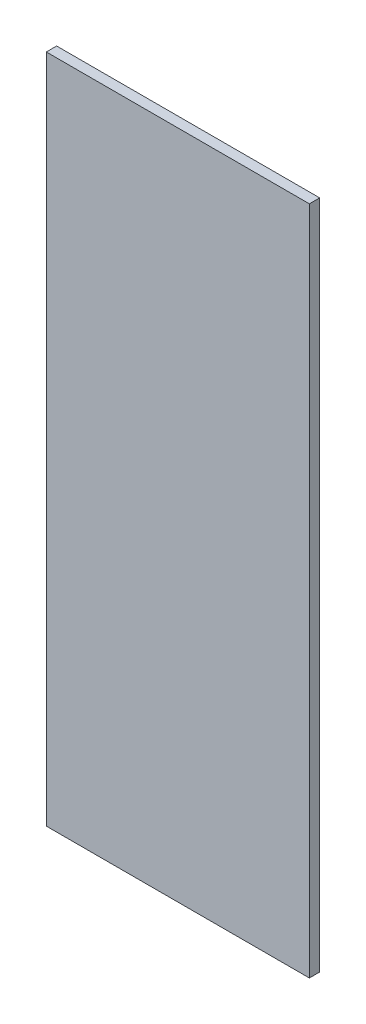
from build123d import *

# Parameters (mm, degrees)
ESQUISSE1_W          = 255
ESQUISSE1_H          = 650
BASE_EXTRUSION_DEPTH = 10


with BuildPart() as part:
    # Esquisse1 → Base-Extrusion (new body)
    with BuildSketch(Plane.XY):
        Rectangle(ESQUISSE1_W, ESQUISSE1_H)
    extrude(amount=BASE_EXTRUSION_DEPTH)


solid = part.part
